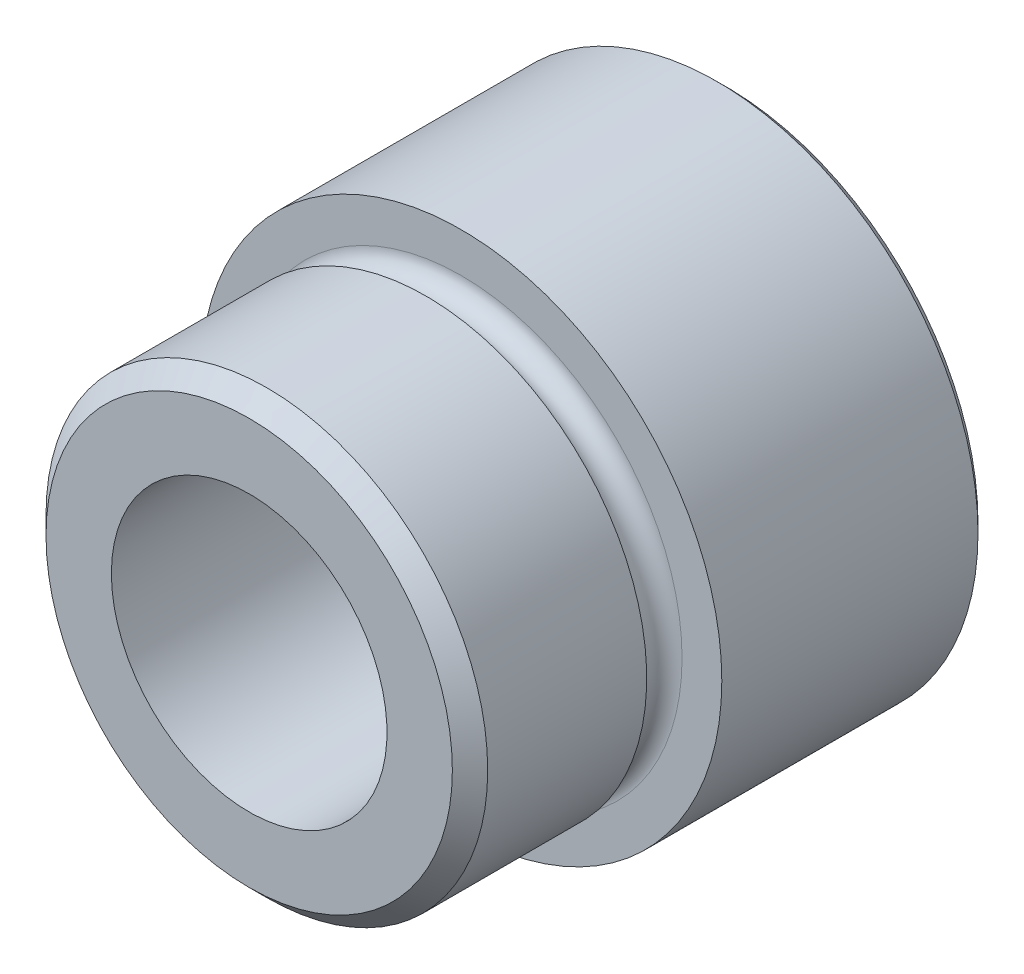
from build123d import *

# Parameters (mm, degrees)
ESQUISSE2_R             = 14.75
EXTRUSION1_DEPTH        = 15
ESQUISSE3_R             = 12.5
EXTRUSION2_DEPTH        = 12
ESQUISSE4_R             = 7.8
ENL_V_MAT_EXTRU_1_DEPTH = 35.119276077
ESQUISSE5_R             = 1
CHANFREIN1_SIZE         = 1
CHANFREIN2_SIZE         = 0.5


with BuildPart() as part:
    # Esquisse2 → Extrusion1 (new body)
    with BuildSketch(Plane.XY):
        Circle(ESQUISSE2_R)
    extrude(amount=EXTRUSION1_DEPTH)

    # Esquisse3 → Extrusion2 (add)
    with BuildSketch(Plane.XY.offset(15)):
        Circle(ESQUISSE3_R)
    extrude(amount=EXTRUSION2_DEPTH)

    # Esquisse4 → Enl_v. mat.-Extru.1 (cut, through all)
    with BuildSketch(Plane(origin=(0, 0, 0), x_dir=(-1, 0, 0), z_dir=(0, 0, -1))):
        Circle(ESQUISSE4_R)
    extrude(amount=-ENL_V_MAT_EXTRU_1_DEPTH, mode=Mode.SUBTRACT)

    # Esquisse5 → Enl_vement de mati_re-R_volution1 (revolve, cut)
    with BuildSketch(Plane(origin=(0, 0, 0), x_dir=(0, 0, -1), z_dir=(1, 0, 0)), mode=Mode.PRIVATE) as enl_vement_de_mati_re_r_volution1_sk:
        with Locations((-16, 12.5)):
            Circle(ESQUISSE5_R)
    revolve(enl_vement_de_mati_re_r_volution1_sk.sketch.rotate(Axis((0, 0, -13.248079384), (0, 0, 1)), 90), axis=Axis((0, 0, -13.248079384), (0, 0, 1)), mode=Mode.SUBTRACT)

    # Chanfrein1
    chanfrein1_edges = [part.edges().sort_by_distance(p)[0] for p in [
        (-12.5, 0, 27),
    ]]
    chamfer(chanfrein1_edges, length=CHANFREIN1_SIZE)

    # Chanfrein2
    chanfrein2_edges = [part.edges().sort_by_distance(p)[0] for p in [
        (-14.75, 0, 0),
    ]]
    chamfer(chanfrein2_edges, length=CHANFREIN2_SIZE)


solid = part.part
